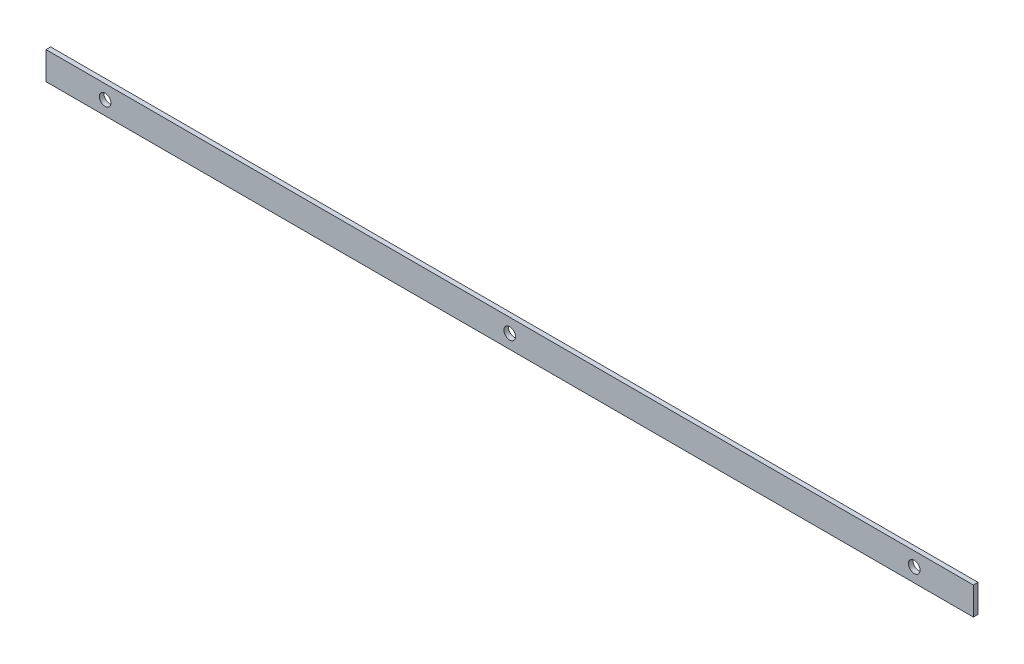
from build123d import *

# Parameters (mm, degrees)
ESQUISSE1_W             = 800
ESQUISSE1_H             = 24
EXTRUSION1_DEPTH        = 4
ESQUISSE2_R             = 5
ENL_V_MAT_EXTRU_1_DEPTH = 4


with BuildPart() as part:
    # Esquisse1 → Extrusion1 (new body)
    with BuildSketch(Plane.XY):
        with Locations((-400, 12)):
            Rectangle(ESQUISSE1_W, ESQUISSE1_H)
    extrude(amount=EXTRUSION1_DEPTH)

    # Esquisse2 → Enl_v. mat.-Extru.1 (cut)
    with BuildSketch(Plane.XY.offset(4)):
        with Locations((-749, 12)):
            Circle(ESQUISSE2_R)
        with Locations((-400, 12)):
            Circle(ESQUISSE2_R)
        with Locations((-51, 12)):
            Circle(ESQUISSE2_R)
    extrude(amount=-ENL_V_MAT_EXTRU_1_DEPTH, mode=Mode.SUBTRACT)


solid = part.part
